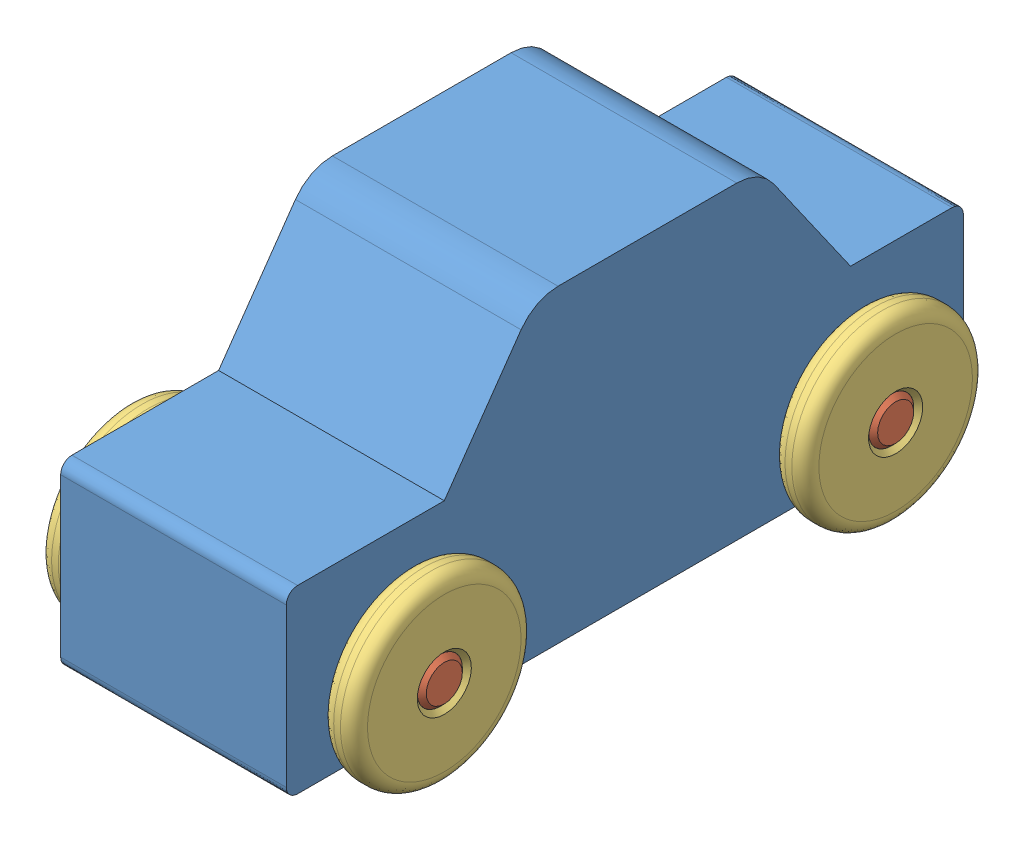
SolidWorks assembly Toy_Car.SLDASM, configuration Default (file format 9000). Lengths in mm.
Overall size (70 80.89 152.33).
7 component instances, 3 part files, 12 mates.
Components (placement in the parent):
- Toy_Car-Body-1: Toy_Car-Body.SLDPRT [Default] at origin size (50 68.56 150)
- Toy_Car-Axle-1: Toy_Car-Axle.SLDPRT [Default] at (0 15 50) x (1 0 0) z (0 -0.865705 0.500555) size (70 15 15)
- Toy_Car-Axle-2: Toy_Car-Axle.SLDPRT [Default] at (0 15 -50) size (70 15 15)
- Toy_Car-Wheel-1: Toy_Car-Wheel.SLDPRT [Default] at (-31.25 15 50) x (1 0 0) z (0 -0.865705 0.500555) size (7.5 40 40)
- Toy_Car-Wheel-2: Toy_Car-Wheel.SLDPRT [Default] at (31.25 15 50) x (1 0 0) z (0 -0.865705 0.500555) size (7.5 40 40)
- Toy_Car-Wheel-3: Toy_Car-Wheel.SLDPRT [Default] at (-31.25 15 -50) size (7.5 40 40)
- Toy_Car-Wheel-4: Toy_Car-Wheel.SLDPRT [Default] at (31.25 15 -50) size (7.5 40 40)
Mates (geometry in assembly coordinates):
- Concentric1: concentric anti-aligned: cylinder of Toy_Car-Axle-1 through (25 15 50) axis (-1 0 0) radius 7.5; cylinder of Toy_Car-Wheel-1 through (-35 15 50) axis (1 0 0) radius 5
- Concentric2: concentric anti-aligned: cylinder of Toy_Car-Axle-1 through (25 15 50) axis (-1 0 0) radius 7.5; cylinder of Toy_Car-Wheel-2 through (27.5 15 50) axis (1 0 0) radius 5
- Coincident1: coincident aligned: plane of Toy_Car-Axle-1 through (-35 15 50) normal (-1 0 0); plane of Toy_Car-Wheel-1 through (-35 15 50) normal (-1 0 0)
- Coincident2: coincident aligned: plane of Toy_Car-Axle-1 through (35 15 50) normal (1 0 0); plane of Toy_Car-Wheel-2 through (35 15 50) normal (1 0 0)
- Concentric3: concentric anti-aligned: cylinder of Toy_Car-Wheel-3 through (-35 15 -50) axis (1 0 0) radius 5; cylinder of Toy_Car-Axle-2 through (25 15 -50) axis (-1 0 0) radius 7.5
- Concentric4: concentric anti-aligned: cylinder of Toy_Car-Axle-2 through (25 15 -50) axis (-1 0 0) radius 7.5; cylinder of Toy_Car-Wheel-4 through (27.5 15 -50) axis (1 0 0) radius 5
- Coincident3: coincident aligned: plane of Toy_Car-Axle-2 through (-35 15 -50) normal (-1 0 0); plane of Toy_Car-Wheel-3 through (-35 15 -50) normal (-1 0 0)
- Coincident4: coincident aligned: plane of Toy_Car-Axle-2 through (35 15 -50) normal (1 0 0); plane of Toy_Car-Wheel-4 through (35 15 -50) normal (1 0 0)
- Concentric5: concentric anti-aligned: cylinder of Toy_Car-Axle-1 through (25 15 50) axis (-1 0 0) radius 7.5; cylinder of Toy_Car-Body-1 through (-25 15 50) axis (1 0 0) radius 7.5
- Symmetric1: symmetric aligned: plane of Toy_Car-Wheel-1 through (-27.5 15 50) normal (1 0 0); plane of Toy_Car-Wheel-2 through (27.5 15 50) normal (-1 0 0); plane of assembly through (0 0 0) normal (1 0 0)
- Symmetric2: symmetric aligned: plane of Toy_Car-Wheel-3 through (-27.5 15 -50) normal (1 0 0); plane of Toy_Car-Wheel-4 through (27.5 15 -50) normal (-1 0 0); plane of assembly through (0 0 0) normal (1 0 0)
- Concentric6: concentric anti-aligned: cylinder of Toy_Car-Body-1 through (-25 15 -50) axis (1 0 0) radius 7.5; cylinder of Toy_Car-Axle-2 through (25 15 -50) axis (-1 0 0) radius 7.5
